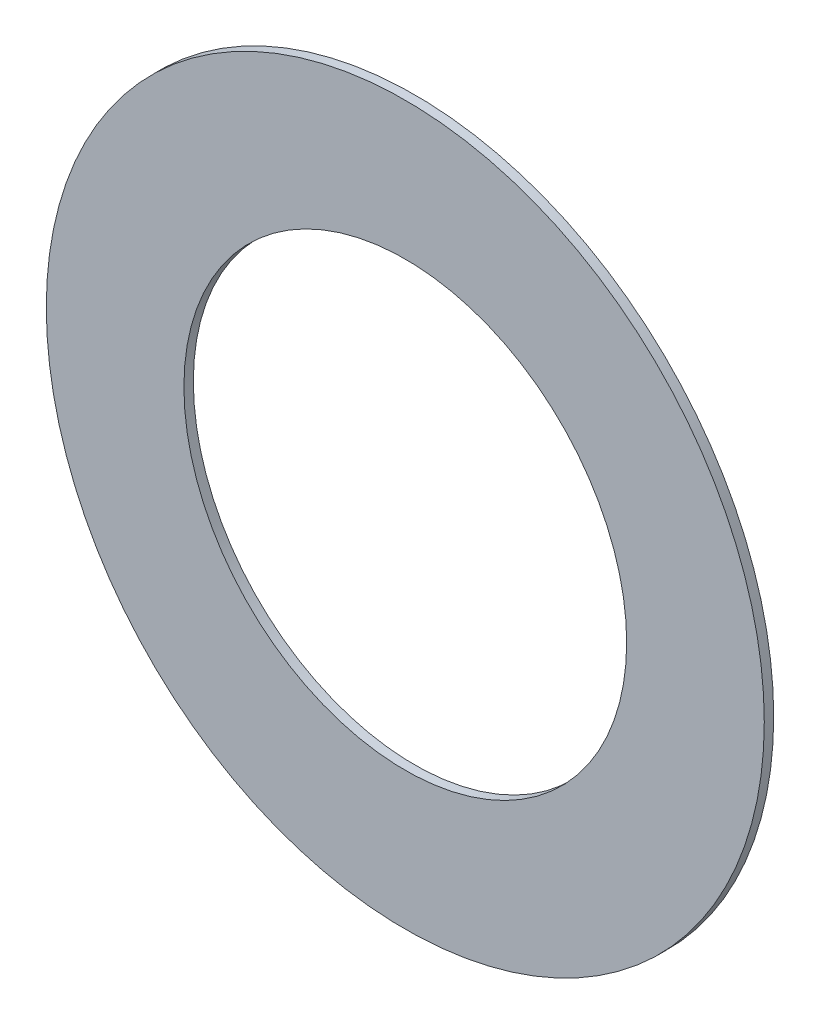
from build123d import *

# Parameters (mm, degrees)
SKETCH1_R           = 38.1
SKETCH1_R_2         = 23.495
BOSS_EXTRUDE1_DEPTH = 1


with BuildPart() as part:
    # Sketch1 → Boss-Extrude1 (new body)
    with BuildSketch(Plane.XY):
        Circle(SKETCH1_R)
        Circle(SKETCH1_R_2, mode=Mode.SUBTRACT)
    extrude(amount=BOSS_EXTRUDE1_DEPTH)


solid = part.part
